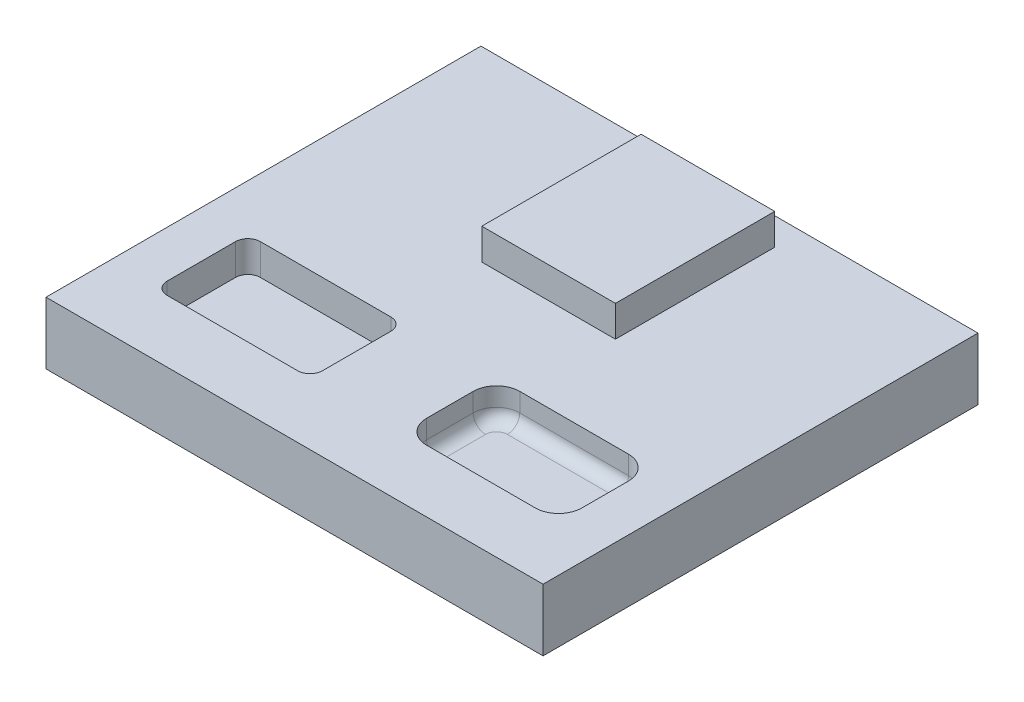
ISO-10303-21;
HEADER;
FILE_DESCRIPTION(('STEP AP214'),'2;1');
FILE_NAME('part.step','',(''),(''),'','','');
FILE_SCHEMA(('AUTOMOTIVE_DESIGN { 1 0 10303 214 1 1 1 1 }'));
ENDSEC;
DATA;
#1=APPLICATION_CONTEXT('core data for automotive mechanical design processes');
#2=APPLICATION_PROTOCOL_DEFINITION('international standard','automotive_design',2000,#1);
#3=PRODUCT_CONTEXT('',#1,'mechanical');
#4=PRODUCT('Part','Part','',(#3));
#5=PRODUCT_RELATED_PRODUCT_CATEGORY('part','',(#4));
#6=PRODUCT_DEFINITION_FORMATION('','',#4);
#7=PRODUCT_DEFINITION_CONTEXT('part definition',#1,'design');
#8=PRODUCT_DEFINITION('design','',#6,#7);
#9=PRODUCT_DEFINITION_SHAPE('','',#8);
#10=(LENGTH_UNIT() NAMED_UNIT(*) SI_UNIT(.MILLI.,.METRE.));
#11=(NAMED_UNIT(*) PLANE_ANGLE_UNIT() SI_UNIT($,.RADIAN.));
#12=(NAMED_UNIT(*) SI_UNIT($,.STERADIAN.) SOLID_ANGLE_UNIT());
#13=UNCERTAINTY_MEASURE_WITH_UNIT(LENGTH_MEASURE(1.E-05),#10,'distance_accuracy_value','');
#14=(GEOMETRIC_REPRESENTATION_CONTEXT(3) GLOBAL_UNCERTAINTY_ASSIGNED_CONTEXT((#13)) GLOBAL_UNIT_ASSIGNED_CONTEXT((#10,
#11,#12)) REPRESENTATION_CONTEXT('',''));
#15=CARTESIAN_POINT('',(0.,0.,0.));
#16=DIRECTION('',(0.,0.,1.));
#17=DIRECTION('',(1.,0.,0.));
#18=AXIS2_PLACEMENT_3D('',#15,#16,#17);
#19=CARTESIAN_POINT('',(60.325,6.35,57.15));
#20=DIRECTION('',(0.,1.,0.));
#21=DIRECTION('',(0.,0.,1.));
#22=AXIS2_PLACEMENT_3D('',#19,#20,#21);
#23=PLANE('',#22);
#24=CARTESIAN_POINT('',(87.3125,6.35,61.9125));
#25=DIRECTION('',(0.,1.,0.));
#26=DIRECTION('',(0.,0.,1.));
#27=AXIS2_PLACEMENT_3D('',#24,#25,#26);
#28=CIRCLE('',#27,2.2225);
#29=CARTESIAN_POINT('',(87.3125,6.35,59.69));
#30=VERTEX_POINT('',#29);
#31=CARTESIAN_POINT('',(89.535,6.35,61.9125));
#32=VERTEX_POINT('',#31);
#33=EDGE_CURVE('E400',#30,#32,#28,.F.);
#34=ORIENTED_EDGE('',*,*,#33,.F.);
#35=DIRECTION('',(-1.,0.,0.));
#36=VECTOR('',#35,1.);
#37=CARTESIAN_POINT('',(60.325,6.35,59.69));
#38=LINE('',#37,#36);
#39=CARTESIAN_POINT('',(65.0875,6.35,59.69));
#40=VERTEX_POINT('',#39);
#41=EDGE_CURVE('E334',#30,#40,#38,.T.);
#42=ORIENTED_EDGE('',*,*,#41,.T.);
#43=CARTESIAN_POINT('',(65.0875,6.35,61.9125));
#44=DIRECTION('',(0.,1.,0.));
#45=DIRECTION('',(0.,0.,1.));
#46=AXIS2_PLACEMENT_3D('',#43,#44,#45);
#47=CIRCLE('',#46,2.2225);
#48=CARTESIAN_POINT('',(62.865,6.35,61.9125));
#49=VERTEX_POINT('',#48);
#50=EDGE_CURVE('E393',#49,#40,#47,.F.);
#51=ORIENTED_EDGE('',*,*,#50,.F.);
#52=DIRECTION('',(0.,0.,1.));
#53=VECTOR('',#52,1.);
#54=CARTESIAN_POINT('',(62.865,6.35,57.15));
#55=LINE('',#54,#53);
#56=CARTESIAN_POINT('',(62.865,6.35,71.4375));
#57=VERTEX_POINT('',#56);
#58=EDGE_CURVE('E337',#49,#57,#55,.T.);
#59=ORIENTED_EDGE('',*,*,#58,.T.);
#60=CARTESIAN_POINT('',(65.0875,6.35,71.4375));
#61=DIRECTION('',(0.,1.,0.));
#62=DIRECTION('',(0.,0.,1.));
#63=AXIS2_PLACEMENT_3D('',#60,#61,#62);
#64=CIRCLE('',#63,2.2225);
#65=CARTESIAN_POINT('',(65.0875,6.35,73.66));
#66=VERTEX_POINT('',#65);
#67=EDGE_CURVE('E396',#66,#57,#64,.F.);
#68=ORIENTED_EDGE('',*,*,#67,.F.);
#69=DIRECTION('',(1.,0.,0.));
#70=VECTOR('',#69,1.);
#71=CARTESIAN_POINT('',(60.325,6.35,73.66));
#72=LINE('',#71,#70);
#73=CARTESIAN_POINT('',(87.3125,6.35,73.66));
#74=VERTEX_POINT('',#73);
#75=EDGE_CURVE('E340',#66,#74,#72,.T.);
#76=ORIENTED_EDGE('',*,*,#75,.T.);
#77=CARTESIAN_POINT('',(87.3125,6.35,71.4375));
#78=DIRECTION('',(0.,1.,0.));
#79=DIRECTION('',(0.,0.,1.));
#80=AXIS2_PLACEMENT_3D('',#77,#78,#79);
#81=CIRCLE('',#80,2.2225);
#82=CARTESIAN_POINT('',(89.535,6.35,71.4375));
#83=VERTEX_POINT('',#82);
#84=EDGE_CURVE('E398',#83,#74,#81,.F.);
#85=ORIENTED_EDGE('',*,*,#84,.F.);
#86=DIRECTION('',(0.,0.,-1.));
#87=VECTOR('',#86,1.);
#88=CARTESIAN_POINT('',(89.535,6.35,57.15));
#89=LINE('',#88,#87);
#90=EDGE_CURVE('E343',#83,#32,#89,.T.);
#91=ORIENTED_EDGE('',*,*,#90,.T.);
#92=EDGE_LOOP('',(#34,#42,#51,#59,#68,#76,#85,#91));
#93=FACE_BOUND('',#92,.T.);
#94=ADVANCED_FACE('F40',(#93),#23,.T.);
#95=CARTESIAN_POINT('',(0.,12.7,88.9));
#96=DIRECTION('',(0.,1.,0.));
#97=DIRECTION('',(0.,0.,1.));
#98=AXIS2_PLACEMENT_3D('',#95,#96,#97);
#99=PLANE('',#98);
#100=DIRECTION('',(1.,0.,0.));
#101=VECTOR('',#100,1.);
#102=CARTESIAN_POINT('',(0.,12.7,88.9));
#103=LINE('',#102,#101);
#104=CARTESIAN_POINT('',(0.,12.7,88.9));
#105=VERTEX_POINT('',#104);
#106=CARTESIAN_POINT('',(101.6,12.7,88.9));
#107=VERTEX_POINT('',#106);
#108=EDGE_CURVE('E313',#105,#107,#103,.T.);
#109=ORIENTED_EDGE('',*,*,#108,.T.);
#110=DIRECTION('',(0.,0.,-1.));
#111=VECTOR('',#110,1.);
#112=CARTESIAN_POINT('',(101.6,12.7,0.));
#113=LINE('',#112,#111);
#114=CARTESIAN_POINT('',(101.6,12.7,0.));
#115=VERTEX_POINT('',#114);
#116=EDGE_CURVE('E316',#107,#115,#113,.T.);
#117=ORIENTED_EDGE('',*,*,#116,.T.);
#118=DIRECTION('',(-1.,0.,0.));
#119=VECTOR('',#118,1.);
#120=CARTESIAN_POINT('',(0.,12.7,0.));
#121=LINE('',#120,#119);
#122=CARTESIAN_POINT('',(0.,12.7,0.));
#123=VERTEX_POINT('',#122);
#124=EDGE_CURVE('E318',#115,#123,#121,.T.);
#125=ORIENTED_EDGE('',*,*,#124,.T.);
#126=DIRECTION('',(0.,0.,1.));
#127=VECTOR('',#126,1.);
#128=CARTESIAN_POINT('',(0.,12.7,88.9));
#129=LINE('',#128,#127);
#130=EDGE_CURVE('E320',#123,#105,#129,.T.);
#131=ORIENTED_EDGE('',*,*,#130,.T.);
#132=EDGE_LOOP('',(#109,#117,#125,#131));
#133=FACE_BOUND('',#132,.T.);
#134=DIRECTION('',(0.,0.,1.));
#135=VECTOR('',#134,1.);
#136=CARTESIAN_POINT('',(9.525,12.7,57.15));
#137=LINE('',#136,#135);
#138=CARTESIAN_POINT('',(9.525,12.7,59.69));
#139=VERTEX_POINT('',#138);
#140=CARTESIAN_POINT('',(9.52500000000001,12.7,73.66));
#141=VERTEX_POINT('',#140);
#142=EDGE_CURVE('E280',#139,#141,#137,.T.);
#143=ORIENTED_EDGE('',*,*,#142,.F.);
#144=CARTESIAN_POINT('',(12.065,12.7,59.69));
#145=DIRECTION('',(0.,1.,0.));
#146=DIRECTION('',(0.,0.,1.));
#147=AXIS2_PLACEMENT_3D('',#144,#145,#146);
#148=CIRCLE('',#147,2.54);
#149=CARTESIAN_POINT('',(12.065,12.7,57.15));
#150=VERTEX_POINT('',#149);
#151=EDGE_CURVE('E391',#139,#150,#148,.F.);
#152=ORIENTED_EDGE('',*,*,#151,.T.);
#153=DIRECTION('',(-1.,0.,0.));
#154=VECTOR('',#153,1.);
#155=CARTESIAN_POINT('',(9.525,12.7,57.15));
#156=LINE('',#155,#154);
#157=CARTESIAN_POINT('',(38.735,12.7,57.15));
#158=VERTEX_POINT('',#157);
#159=EDGE_CURVE('E289',#158,#150,#156,.T.);
#160=ORIENTED_EDGE('',*,*,#159,.F.);
#161=CARTESIAN_POINT('',(38.735,12.7,59.69));
#162=DIRECTION('',(0.,1.,0.));
#163=DIRECTION('',(0.,0.,1.));
#164=AXIS2_PLACEMENT_3D('',#161,#162,#163);
#165=CIRCLE('',#164,2.54);
#166=CARTESIAN_POINT('',(41.275,12.7,59.69));
#167=VERTEX_POINT('',#166);
#168=EDGE_CURVE('E387',#158,#167,#165,.F.);
#169=ORIENTED_EDGE('',*,*,#168,.T.);
#170=DIRECTION('',(0.,0.,-1.));
#171=VECTOR('',#170,1.);
#172=CARTESIAN_POINT('',(41.275,12.7,57.15));
#173=LINE('',#172,#171);
#174=CARTESIAN_POINT('',(41.275,12.7,73.66));
#175=VERTEX_POINT('',#174);
#176=EDGE_CURVE('E286',#175,#167,#173,.T.);
#177=ORIENTED_EDGE('',*,*,#176,.F.);
#178=CARTESIAN_POINT('',(38.735,12.7,73.66));
#179=DIRECTION('',(0.,1.,0.));
#180=DIRECTION('',(0.,0.,1.));
#181=AXIS2_PLACEMENT_3D('',#178,#179,#180);
#182=CIRCLE('',#181,2.54);
#183=CARTESIAN_POINT('',(38.735,12.7,76.2));
#184=VERTEX_POINT('',#183);
#185=EDGE_CURVE('E385',#175,#184,#182,.F.);
#186=ORIENTED_EDGE('',*,*,#185,.T.);
#187=DIRECTION('',(1.,0.,0.));
#188=VECTOR('',#187,1.);
#189=CARTESIAN_POINT('',(9.52500000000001,12.7,76.2));
#190=LINE('',#189,#188);
#191=CARTESIAN_POINT('',(12.065,12.7,76.2));
#192=VERTEX_POINT('',#191);
#193=EDGE_CURVE('E283',#192,#184,#190,.T.);
#194=ORIENTED_EDGE('',*,*,#193,.F.);
#195=CARTESIAN_POINT('',(12.065,12.7,73.66));
#196=DIRECTION('',(0.,1.,0.));
#197=DIRECTION('',(0.,0.,1.));
#198=AXIS2_PLACEMENT_3D('',#195,#196,#197);
#199=CIRCLE('',#198,2.54);
#200=EDGE_CURVE('E389',#192,#141,#199,.F.);
#201=ORIENTED_EDGE('',*,*,#200,.T.);
#202=EDGE_LOOP('',(#143,#152,#160,#169,#177,#186,#194,#201));
#203=FACE_BOUND('',#202,.T.);
#204=DIRECTION('',(0.,0.,1.));
#205=VECTOR('',#204,1.);
#206=CARTESIAN_POINT('',(60.325,12.7,57.15));
#207=LINE('',#206,#205);
#208=CARTESIAN_POINT('',(60.325,12.7,61.9125));
#209=VERTEX_POINT('',#208);
#210=CARTESIAN_POINT('',(60.325,12.7,71.4375));
#211=VERTEX_POINT('',#210);
#212=EDGE_CURVE('E235',#209,#211,#207,.T.);
#213=ORIENTED_EDGE('',*,*,#212,.F.);
#214=CARTESIAN_POINT('',(65.0875,12.7,61.9125));
#215=DIRECTION('',(0.,1.,0.));
#216=DIRECTION('',(0.,0.,1.));
#217=AXIS2_PLACEMENT_3D('',#214,#215,#216);
#218=CIRCLE('',#217,4.7625);
#219=CARTESIAN_POINT('',(65.0875,12.7,57.15));
#220=VERTEX_POINT('',#219);
#221=EDGE_CURVE('E436',#209,#220,#218,.F.);
#222=ORIENTED_EDGE('',*,*,#221,.T.);
#223=DIRECTION('',(-1.,0.,0.));
#224=VECTOR('',#223,1.);
#225=CARTESIAN_POINT('',(60.325,12.7,57.15));
#226=LINE('',#225,#224);
#227=CARTESIAN_POINT('',(87.3125,12.7,57.15));
#228=VERTEX_POINT('',#227);
#229=EDGE_CURVE('E277',#228,#220,#226,.T.);
#230=ORIENTED_EDGE('',*,*,#229,.F.);
#231=CARTESIAN_POINT('',(87.3125,12.7,61.9125));
#232=DIRECTION('',(0.,1.,0.));
#233=DIRECTION('',(0.,0.,1.));
#234=AXIS2_PLACEMENT_3D('',#231,#232,#233);
#235=CIRCLE('',#234,4.7625);
#236=CARTESIAN_POINT('',(92.075,12.7,61.9125));
#237=VERTEX_POINT('',#236);
#238=EDGE_CURVE('E12',#228,#237,#235,.F.);
#239=ORIENTED_EDGE('',*,*,#238,.T.);
#240=DIRECTION('',(0.,0.,-1.));
#241=VECTOR('',#240,1.);
#242=CARTESIAN_POINT('',(92.075,12.7,57.15));
#243=LINE('',#242,#241);
#244=CARTESIAN_POINT('',(92.075,12.7,71.4375));
#245=VERTEX_POINT('',#244);
#246=EDGE_CURVE('E275',#245,#237,#243,.T.);
#247=ORIENTED_EDGE('',*,*,#246,.F.);
#248=CARTESIAN_POINT('',(87.3125,12.7,71.4375));
#249=DIRECTION('',(0.,1.,0.));
#250=DIRECTION('',(0.,0.,1.));
#251=AXIS2_PLACEMENT_3D('',#248,#249,#250);
#252=CIRCLE('',#251,4.7625);
#253=CARTESIAN_POINT('',(87.3125,12.7,76.2));
#254=VERTEX_POINT('',#253);
#255=EDGE_CURVE('E48',#245,#254,#252,.F.);
#256=ORIENTED_EDGE('',*,*,#255,.T.);
#257=DIRECTION('',(1.,0.,0.));
#258=VECTOR('',#257,1.);
#259=CARTESIAN_POINT('',(60.325,12.7,76.2));
#260=LINE('',#259,#258);
#261=CARTESIAN_POINT('',(65.0875,12.7,76.2));
#262=VERTEX_POINT('',#261);
#263=EDGE_CURVE('E272',#262,#254,#260,.T.);
#264=ORIENTED_EDGE('',*,*,#263,.F.);
#265=CARTESIAN_POINT('',(65.0875,12.7,71.4375));
#266=DIRECTION('',(0.,1.,0.));
#267=DIRECTION('',(0.,0.,1.));
#268=AXIS2_PLACEMENT_3D('',#265,#266,#267);
#269=CIRCLE('',#268,4.7625);
#270=EDGE_CURVE('E438',#262,#211,#269,.F.);
#271=ORIENTED_EDGE('',*,*,#270,.T.);
#272=EDGE_LOOP('',(#213,#222,#230,#239,#247,#256,#264,#271));
#273=FACE_BOUND('',#272,.T.);
#274=DIRECTION('',(-1.,0.,0.));
#275=VECTOR('',#274,1.);
#276=CARTESIAN_POINT('',(65.6347578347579,12.7,5.57931623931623));
#277=LINE('',#276,#275);
#278=CARTESIAN_POINT('',(65.6347578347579,12.7,5.57931623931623));
#279=VERTEX_POINT('',#278);
#280=CARTESIAN_POINT('',(38.3170940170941,12.7,5.57931623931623));
#281=VERTEX_POINT('',#280);
#282=EDGE_CURVE('E229',#279,#281,#277,.T.);
#283=ORIENTED_EDGE('',*,*,#282,.F.);
#284=DIRECTION('',(0.,0.,-1.));
#285=VECTOR('',#284,1.);
#286=CARTESIAN_POINT('',(65.6347578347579,12.7,5.57931623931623));
#287=LINE('',#286,#285);
#288=CARTESIAN_POINT('',(65.6347578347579,12.7,38.1434188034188));
#289=VERTEX_POINT('',#288);
#290=EDGE_CURVE('E240',#289,#279,#287,.T.);
#291=ORIENTED_EDGE('',*,*,#290,.F.);
#292=DIRECTION('',(1.,0.,0.));
#293=VECTOR('',#292,1.);
#294=CARTESIAN_POINT('',(65.6347578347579,12.7,38.1434188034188));
#295=LINE('',#294,#293);
#296=CARTESIAN_POINT('',(38.3170940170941,12.7,38.1434188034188));
#297=VERTEX_POINT('',#296);
#298=EDGE_CURVE('E253',#297,#289,#295,.T.);
#299=ORIENTED_EDGE('',*,*,#298,.F.);
#300=DIRECTION('',(0.,0.,1.));
#301=VECTOR('',#300,1.);
#302=CARTESIAN_POINT('',(38.3170940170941,12.7,5.57931623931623));
#303=LINE('',#302,#301);
#304=EDGE_CURVE('E251',#281,#297,#303,.T.);
#305=ORIENTED_EDGE('',*,*,#304,.F.);
#306=EDGE_LOOP('',(#283,#291,#299,#305));
#307=FACE_BOUND('',#306,.T.);
#308=ADVANCED_FACE('F249',(#133,#203,#273,#307),#99,.T.);
#309=CARTESIAN_POINT('',(0.,12.7,88.9));
#310=DIRECTION('',(0.,0.,-1.));
#311=DIRECTION('',(-1.,0.,0.));
#312=AXIS2_PLACEMENT_3D('',#309,#310,#311);
#313=PLANE('',#312);
#314=DIRECTION('',(1.,0.,0.));
#315=VECTOR('',#314,1.);
#316=CARTESIAN_POINT('',(0.,0.,88.9));
#317=LINE('',#316,#315);
#318=CARTESIAN_POINT('',(0.,0.,88.9));
#319=VERTEX_POINT('',#318);
#320=CARTESIAN_POINT('',(101.6,0.,88.9));
#321=VERTEX_POINT('',#320);
#322=EDGE_CURVE('E304',#319,#321,#317,.T.);
#323=ORIENTED_EDGE('',*,*,#322,.T.);
#324=DIRECTION('',(0.,-1.,0.));
#325=VECTOR('',#324,1.);
#326=CARTESIAN_POINT('',(101.6,12.7,88.9));
#327=LINE('',#326,#325);
#328=EDGE_CURVE('E331',#107,#321,#327,.T.);
#329=ORIENTED_EDGE('',*,*,#328,.F.);
#330=ORIENTED_EDGE('',*,*,#108,.F.);
#331=DIRECTION('',(0.,-1.,0.));
#332=VECTOR('',#331,1.);
#333=CARTESIAN_POINT('',(0.,12.7,88.9));
#334=LINE('',#333,#332);
#335=EDGE_CURVE('E322',#105,#319,#334,.T.);
#336=ORIENTED_EDGE('',*,*,#335,.T.);
#337=EDGE_LOOP('',(#323,#329,#330,#336));
#338=FACE_BOUND('',#337,.T.);
#339=ADVANCED_FACE('F42',(#338),#313,.F.);
#340=CARTESIAN_POINT('',(101.6,12.7,0.));
#341=DIRECTION('',(-1.,0.,0.));
#342=DIRECTION('',(0.,0.,1.));
#343=AXIS2_PLACEMENT_3D('',#340,#341,#342);
#344=PLANE('',#343);
#345=DIRECTION('',(0.,0.,-1.));
#346=VECTOR('',#345,1.);
#347=CARTESIAN_POINT('',(101.6,0.,0.));
#348=LINE('',#347,#346);
#349=CARTESIAN_POINT('',(101.6,0.,0.));
#350=VERTEX_POINT('',#349);
#351=EDGE_CURVE('E307',#321,#350,#348,.T.);
#352=ORIENTED_EDGE('',*,*,#351,.T.);
#353=DIRECTION('',(0.,-1.,0.));
#354=VECTOR('',#353,1.);
#355=CARTESIAN_POINT('',(101.6,12.7,0.));
#356=LINE('',#355,#354);
#357=EDGE_CURVE('E328',#115,#350,#356,.T.);
#358=ORIENTED_EDGE('',*,*,#357,.F.);
#359=ORIENTED_EDGE('',*,*,#116,.F.);
#360=ORIENTED_EDGE('',*,*,#328,.T.);
#361=EDGE_LOOP('',(#352,#358,#359,#360));
#362=FACE_BOUND('',#361,.T.);
#363=ADVANCED_FACE('F565',(#362),#344,.F.);
#364=CARTESIAN_POINT('',(0.,12.7,0.));
#365=DIRECTION('',(0.,0.,1.));
#366=DIRECTION('',(1.,0.,0.));
#367=AXIS2_PLACEMENT_3D('',#364,#365,#366);
#368=PLANE('',#367);
#369=DIRECTION('',(-1.,0.,0.));
#370=VECTOR('',#369,1.);
#371=CARTESIAN_POINT('',(0.,0.,0.));
#372=LINE('',#371,#370);
#373=CARTESIAN_POINT('',(0.,0.,0.));
#374=VERTEX_POINT('',#373);
#375=EDGE_CURVE('E309',#350,#374,#372,.T.);
#376=ORIENTED_EDGE('',*,*,#375,.T.);
#377=DIRECTION('',(0.,-1.,0.));
#378=VECTOR('',#377,1.);
#379=CARTESIAN_POINT('',(0.,12.7,0.));
#380=LINE('',#379,#378);
#381=EDGE_CURVE('E325',#123,#374,#380,.T.);
#382=ORIENTED_EDGE('',*,*,#381,.F.);
#383=ORIENTED_EDGE('',*,*,#124,.F.);
#384=ORIENTED_EDGE('',*,*,#357,.T.);
#385=EDGE_LOOP('',(#376,#382,#383,#384));
#386=FACE_BOUND('',#385,.T.);
#387=ADVANCED_FACE('F562',(#386),#368,.F.);
#388=CARTESIAN_POINT('',(0.,12.7,88.9));
#389=DIRECTION('',(1.,0.,0.));
#390=DIRECTION('',(0.,0.,-1.));
#391=AXIS2_PLACEMENT_3D('',#388,#389,#390);
#392=PLANE('',#391);
#393=DIRECTION('',(0.,0.,1.));
#394=VECTOR('',#393,1.);
#395=CARTESIAN_POINT('',(0.,0.,88.9));
#396=LINE('',#395,#394);
#397=EDGE_CURVE('E311',#374,#319,#396,.T.);
#398=ORIENTED_EDGE('',*,*,#397,.T.);
#399=ORIENTED_EDGE('',*,*,#335,.F.);
#400=ORIENTED_EDGE('',*,*,#130,.F.);
#401=ORIENTED_EDGE('',*,*,#381,.T.);
#402=EDGE_LOOP('',(#398,#399,#400,#401));
#403=FACE_BOUND('',#402,.T.);
#404=ADVANCED_FACE('F557',(#403),#392,.F.);
#405=CARTESIAN_POINT('',(0.,0.,88.9));
#406=DIRECTION('',(0.,1.,0.));
#407=DIRECTION('',(0.,0.,1.));
#408=AXIS2_PLACEMENT_3D('',#405,#406,#407);
#409=PLANE('',#408);
#410=ORIENTED_EDGE('',*,*,#322,.F.);
#411=ORIENTED_EDGE('',*,*,#397,.F.);
#412=ORIENTED_EDGE('',*,*,#375,.F.);
#413=ORIENTED_EDGE('',*,*,#351,.F.);
#414=EDGE_LOOP('',(#410,#411,#412,#413));
#415=FACE_BOUND('',#414,.T.);
#416=ADVANCED_FACE('F554',(#415),#409,.F.);
#417=CARTESIAN_POINT('',(9.525,6.35,57.15));
#418=DIRECTION('',(-1.,0.,0.));
#419=DIRECTION('',(0.,0.,1.));
#420=AXIS2_PLACEMENT_3D('',#417,#418,#419);
#421=PLANE('',#420);
#422=ORIENTED_EDGE('',*,*,#142,.T.);
#423=DIRECTION('',(0.,1.,0.));
#424=VECTOR('',#423,1.);
#425=CARTESIAN_POINT('',(9.52500000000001,6.35,73.66));
#426=LINE('',#425,#424);
#427=CARTESIAN_POINT('',(9.52500000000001,6.35,73.66));
#428=VERTEX_POINT('',#427);
#429=EDGE_CURVE('E383',#141,#428,#426,.F.);
#430=ORIENTED_EDGE('',*,*,#429,.T.);
#431=DIRECTION('',(0.,0.,1.));
#432=VECTOR('',#431,1.);
#433=CARTESIAN_POINT('',(9.525,6.35,57.15));
#434=LINE('',#433,#432);
#435=CARTESIAN_POINT('',(9.525,6.35,59.69));
#436=VERTEX_POINT('',#435);
#437=EDGE_CURVE('E292',#436,#428,#434,.T.);
#438=ORIENTED_EDGE('',*,*,#437,.F.);
#439=DIRECTION('',(0.,1.,0.));
#440=VECTOR('',#439,1.);
#441=CARTESIAN_POINT('',(9.525,12.7,59.69));
#442=LINE('',#441,#440);
#443=EDGE_CURVE('E380',#436,#139,#442,.T.);
#444=ORIENTED_EDGE('',*,*,#443,.T.);
#445=EDGE_LOOP('',(#422,#430,#438,#444));
#446=FACE_BOUND('',#445,.T.);
#447=ADVANCED_FACE('F544',(#446),#421,.F.);
#448=CARTESIAN_POINT('',(9.525,6.35,57.15));
#449=DIRECTION('',(0.,0.,-1.));
#450=DIRECTION('',(-1.,0.,0.));
#451=AXIS2_PLACEMENT_3D('',#448,#449,#450);
#452=PLANE('',#451);
#453=DIRECTION('',(-1.,0.,0.));
#454=VECTOR('',#453,1.);
#455=CARTESIAN_POINT('',(9.525,6.35,57.15));
#456=LINE('',#455,#454);
#457=CARTESIAN_POINT('',(38.735,6.35,57.15));
#458=VERTEX_POINT('',#457);
#459=CARTESIAN_POINT('',(12.065,6.35,57.15));
#460=VERTEX_POINT('',#459);
#461=EDGE_CURVE('E301',#458,#460,#456,.T.);
#462=ORIENTED_EDGE('',*,*,#461,.F.);
#463=DIRECTION('',(0.,1.,0.));
#464=VECTOR('',#463,1.);
#465=CARTESIAN_POINT('',(38.735,12.7,57.15));
#466=LINE('',#465,#464);
#467=EDGE_CURVE('E377',#458,#158,#466,.T.);
#468=ORIENTED_EDGE('',*,*,#467,.T.);
#469=ORIENTED_EDGE('',*,*,#159,.T.);
#470=DIRECTION('',(0.,1.,0.));
#471=VECTOR('',#470,1.);
#472=CARTESIAN_POINT('',(12.065,6.35,57.15));
#473=LINE('',#472,#471);
#474=EDGE_CURVE('E375',#150,#460,#473,.F.);
#475=ORIENTED_EDGE('',*,*,#474,.T.);
#476=EDGE_LOOP('',(#462,#468,#469,#475));
#477=FACE_BOUND('',#476,.T.);
#478=ADVANCED_FACE('F540',(#477),#452,.F.);
#479=CARTESIAN_POINT('',(41.275,6.35,57.15));
#480=DIRECTION('',(1.,0.,0.));
#481=DIRECTION('',(0.,0.,-1.));
#482=AXIS2_PLACEMENT_3D('',#479,#480,#481);
#483=PLANE('',#482);
#484=DIRECTION('',(0.,0.,-1.));
#485=VECTOR('',#484,1.);
#486=CARTESIAN_POINT('',(41.275,6.35,57.15));
#487=LINE('',#486,#485);
#488=CARTESIAN_POINT('',(41.275,6.35,73.66));
#489=VERTEX_POINT('',#488);
#490=CARTESIAN_POINT('',(41.275,6.35,59.69));
#491=VERTEX_POINT('',#490);
#492=EDGE_CURVE('E298',#489,#491,#487,.T.);
#493=ORIENTED_EDGE('',*,*,#492,.F.);
#494=DIRECTION('',(0.,1.,0.));
#495=VECTOR('',#494,1.);
#496=CARTESIAN_POINT('',(41.275,12.7,73.66));
#497=LINE('',#496,#495);
#498=EDGE_CURVE('E359',#489,#175,#497,.T.);
#499=ORIENTED_EDGE('',*,*,#498,.T.);
#500=ORIENTED_EDGE('',*,*,#176,.T.);
#501=DIRECTION('',(0.,1.,0.));
#502=VECTOR('',#501,1.);
#503=CARTESIAN_POINT('',(41.275,6.35,59.69));
#504=LINE('',#503,#502);
#505=EDGE_CURVE('E357',#167,#491,#504,.F.);
#506=ORIENTED_EDGE('',*,*,#505,.T.);
#507=EDGE_LOOP('',(#493,#499,#500,#506));
#508=FACE_BOUND('',#507,.T.);
#509=ADVANCED_FACE('F543',(#508),#483,.F.);
#510=CARTESIAN_POINT('',(9.52500000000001,6.35,76.2));
#511=DIRECTION('',(0.,0.,1.));
#512=DIRECTION('',(1.,0.,0.));
#513=AXIS2_PLACEMENT_3D('',#510,#511,#512);
#514=PLANE('',#513);
#515=ORIENTED_EDGE('',*,*,#193,.T.);
#516=DIRECTION('',(0.,1.,0.));
#517=VECTOR('',#516,1.);
#518=CARTESIAN_POINT('',(38.735,6.35,76.2));
#519=LINE('',#518,#517);
#520=CARTESIAN_POINT('',(38.735,6.35,76.2));
#521=VERTEX_POINT('',#520);
#522=EDGE_CURVE('E365',#184,#521,#519,.F.);
#523=ORIENTED_EDGE('',*,*,#522,.T.);
#524=DIRECTION('',(1.,0.,0.));
#525=VECTOR('',#524,1.);
#526=CARTESIAN_POINT('',(9.52500000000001,6.35,76.2));
#527=LINE('',#526,#525);
#528=CARTESIAN_POINT('',(12.065,6.35,76.2));
#529=VERTEX_POINT('',#528);
#530=EDGE_CURVE('E295',#529,#521,#527,.T.);
#531=ORIENTED_EDGE('',*,*,#530,.F.);
#532=DIRECTION('',(0.,1.,0.));
#533=VECTOR('',#532,1.);
#534=CARTESIAN_POINT('',(12.065,12.7,76.2));
#535=LINE('',#534,#533);
#536=EDGE_CURVE('E362',#529,#192,#535,.T.);
#537=ORIENTED_EDGE('',*,*,#536,.T.);
#538=EDGE_LOOP('',(#515,#523,#531,#537));
#539=FACE_BOUND('',#538,.T.);
#540=ADVANCED_FACE('F538',(#539),#514,.F.);
#541=CARTESIAN_POINT('',(9.52500000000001,6.35,76.2));
#542=DIRECTION('',(0.,1.,0.));
#543=DIRECTION('',(0.,0.,1.));
#544=AXIS2_PLACEMENT_3D('',#541,#542,#543);
#545=PLANE('',#544);
#546=ORIENTED_EDGE('',*,*,#530,.T.);
#547=CARTESIAN_POINT('',(38.735,6.35,73.66));
#548=DIRECTION('',(0.,1.,0.));
#549=DIRECTION('',(0.,0.,1.));
#550=AXIS2_PLACEMENT_3D('',#547,#548,#549);
#551=CIRCLE('',#550,2.54);
#552=EDGE_CURVE('E373',#521,#489,#551,.T.);
#553=ORIENTED_EDGE('',*,*,#552,.T.);
#554=ORIENTED_EDGE('',*,*,#492,.T.);
#555=CARTESIAN_POINT('',(38.735,6.35,59.69));
#556=DIRECTION('',(0.,1.,0.));
#557=DIRECTION('',(0.,0.,1.));
#558=AXIS2_PLACEMENT_3D('',#555,#556,#557);
#559=CIRCLE('',#558,2.54);
#560=EDGE_CURVE('E371',#491,#458,#559,.T.);
#561=ORIENTED_EDGE('',*,*,#560,.T.);
#562=ORIENTED_EDGE('',*,*,#461,.T.);
#563=CARTESIAN_POINT('',(12.065,6.35,59.69));
#564=DIRECTION('',(0.,1.,0.));
#565=DIRECTION('',(0.,0.,1.));
#566=AXIS2_PLACEMENT_3D('',#563,#564,#565);
#567=CIRCLE('',#566,2.54);
#568=EDGE_CURVE('E367',#460,#436,#567,.T.);
#569=ORIENTED_EDGE('',*,*,#568,.T.);
#570=ORIENTED_EDGE('',*,*,#437,.T.);
#571=CARTESIAN_POINT('',(12.065,6.35,73.66));
#572=DIRECTION('',(0.,1.,0.));
#573=DIRECTION('',(0.,0.,1.));
#574=AXIS2_PLACEMENT_3D('',#571,#572,#573);
#575=CIRCLE('',#574,2.54);
#576=EDGE_CURVE('E369',#428,#529,#575,.T.);
#577=ORIENTED_EDGE('',*,*,#576,.T.);
#578=EDGE_LOOP('',(#546,#553,#554,#561,#562,#569,#570,#577));
#579=FACE_BOUND('',#578,.T.);
#580=ADVANCED_FACE('F535',(#579),#545,.T.);
#581=CARTESIAN_POINT('',(60.325,6.35,57.15));
#582=DIRECTION('',(-1.,0.,0.));
#583=DIRECTION('',(0.,0.,1.));
#584=AXIS2_PLACEMENT_3D('',#581,#582,#583);
#585=PLANE('',#584);
#586=DIRECTION('',(0.,0.,1.));
#587=VECTOR('',#586,1.);
#588=CARTESIAN_POINT('',(60.325,8.89,57.15));
#589=LINE('',#588,#587);
#590=CARTESIAN_POINT('',(60.325,8.89,71.4375));
#591=VERTEX_POINT('',#590);
#592=CARTESIAN_POINT('',(60.325,8.89,61.9125));
#593=VERTEX_POINT('',#592);
#594=EDGE_CURVE('E351',#591,#593,#589,.F.);
#595=ORIENTED_EDGE('',*,*,#594,.T.);
#596=DIRECTION('',(0.,1.,0.));
#597=VECTOR('',#596,1.);
#598=CARTESIAN_POINT('',(60.325,12.7,61.9125));
#599=LINE('',#598,#597);
#600=EDGE_CURVE('E423',#593,#209,#599,.T.);
#601=ORIENTED_EDGE('',*,*,#600,.T.);
#602=ORIENTED_EDGE('',*,*,#212,.T.);
#603=DIRECTION('',(0.,1.,0.));
#604=VECTOR('',#603,1.);
#605=CARTESIAN_POINT('',(60.325,8.89,71.4375));
#606=LINE('',#605,#604);
#607=EDGE_CURVE('E421',#211,#591,#606,.F.);
#608=ORIENTED_EDGE('',*,*,#607,.T.);
#609=EDGE_LOOP('',(#595,#601,#602,#608));
#610=FACE_BOUND('',#609,.T.);
#611=ADVANCED_FACE('F528',(#610),#585,.F.);
#612=CARTESIAN_POINT('',(60.325,6.35,57.15));
#613=DIRECTION('',(0.,0.,-1.));
#614=DIRECTION('',(-1.,0.,0.));
#615=AXIS2_PLACEMENT_3D('',#612,#613,#614);
#616=PLANE('',#615);
#617=ORIENTED_EDGE('',*,*,#229,.T.);
#618=DIRECTION('',(0.,1.,0.));
#619=VECTOR('',#618,1.);
#620=CARTESIAN_POINT('',(65.0875,8.89,57.15));
#621=LINE('',#620,#619);
#622=CARTESIAN_POINT('',(65.0875,8.89,57.15));
#623=VERTEX_POINT('',#622);
#624=EDGE_CURVE('E427',#220,#623,#621,.F.);
#625=ORIENTED_EDGE('',*,*,#624,.T.);
#626=DIRECTION('',(-1.,0.,0.));
#627=VECTOR('',#626,1.);
#628=CARTESIAN_POINT('',(60.325,8.89,57.15));
#629=LINE('',#628,#627);
#630=CARTESIAN_POINT('',(87.3125,8.89,57.15));
#631=VERTEX_POINT('',#630);
#632=EDGE_CURVE('E354',#623,#631,#629,.F.);
#633=ORIENTED_EDGE('',*,*,#632,.T.);
#634=DIRECTION('',(0.,1.,0.));
#635=VECTOR('',#634,1.);
#636=CARTESIAN_POINT('',(87.3125,12.7,57.15));
#637=LINE('',#636,#635);
#638=EDGE_CURVE('E425',#631,#228,#637,.T.);
#639=ORIENTED_EDGE('',*,*,#638,.T.);
#640=EDGE_LOOP('',(#617,#625,#633,#639));
#641=FACE_BOUND('',#640,.T.);
#642=ADVANCED_FACE('F495',(#641),#616,.F.);
#643=CARTESIAN_POINT('',(92.075,6.35,57.15));
#644=DIRECTION('',(1.,0.,0.));
#645=DIRECTION('',(0.,0.,-1.));
#646=AXIS2_PLACEMENT_3D('',#643,#644,#645);
#647=PLANE('',#646);
#648=DIRECTION('',(0.,0.,-1.));
#649=VECTOR('',#648,1.);
#650=CARTESIAN_POINT('',(92.075,8.89,57.15));
#651=LINE('',#650,#649);
#652=CARTESIAN_POINT('',(92.075,8.89,61.9125));
#653=VERTEX_POINT('',#652);
#654=CARTESIAN_POINT('',(92.075,8.89,71.4375));
#655=VERTEX_POINT('',#654);
#656=EDGE_CURVE('E346',#653,#655,#651,.F.);
#657=ORIENTED_EDGE('',*,*,#656,.T.);
#658=DIRECTION('',(0.,1.,0.));
#659=VECTOR('',#658,1.);
#660=CARTESIAN_POINT('',(92.075,12.7,71.4375));
#661=LINE('',#660,#659);
#662=EDGE_CURVE('E60',#655,#245,#661,.T.);
#663=ORIENTED_EDGE('',*,*,#662,.T.);
#664=ORIENTED_EDGE('',*,*,#246,.T.);
#665=DIRECTION('',(0.,1.,0.));
#666=VECTOR('',#665,1.);
#667=CARTESIAN_POINT('',(92.075,8.89,61.9125));
#668=LINE('',#667,#666);
#669=EDGE_CURVE('E433',#237,#653,#668,.F.);
#670=ORIENTED_EDGE('',*,*,#669,.T.);
#671=EDGE_LOOP('',(#657,#663,#664,#670));
#672=FACE_BOUND('',#671,.T.);
#673=ADVANCED_FACE('F527',(#672),#647,.F.);
#674=CARTESIAN_POINT('',(60.325,6.35,76.2));
#675=DIRECTION('',(0.,0.,1.));
#676=DIRECTION('',(1.,0.,0.));
#677=AXIS2_PLACEMENT_3D('',#674,#675,#676);
#678=PLANE('',#677);
#679=DIRECTION('',(1.,0.,0.));
#680=VECTOR('',#679,1.);
#681=CARTESIAN_POINT('',(60.325,8.89,76.2));
#682=LINE('',#681,#680);
#683=CARTESIAN_POINT('',(87.3125,8.89,76.2));
#684=VERTEX_POINT('',#683);
#685=CARTESIAN_POINT('',(65.0875,8.89,76.2));
#686=VERTEX_POINT('',#685);
#687=EDGE_CURVE('E348',#684,#686,#682,.F.);
#688=ORIENTED_EDGE('',*,*,#687,.T.);
#689=DIRECTION('',(0.,1.,0.));
#690=VECTOR('',#689,1.);
#691=CARTESIAN_POINT('',(65.0875,12.7,76.2));
#692=LINE('',#691,#690);
#693=EDGE_CURVE('E431',#686,#262,#692,.T.);
#694=ORIENTED_EDGE('',*,*,#693,.T.);
#695=ORIENTED_EDGE('',*,*,#263,.T.);
#696=DIRECTION('',(0.,1.,0.));
#697=VECTOR('',#696,1.);
#698=CARTESIAN_POINT('',(87.3125,8.89,76.2));
#699=LINE('',#698,#697);
#700=EDGE_CURVE('E429',#254,#684,#699,.F.);
#701=ORIENTED_EDGE('',*,*,#700,.T.);
#702=EDGE_LOOP('',(#688,#694,#695,#701));
#703=FACE_BOUND('',#702,.T.);
#704=ADVANCED_FACE('F446',(#703),#678,.F.);
#705=CARTESIAN_POINT('',(62.865,8.89,57.15));
#706=DIRECTION('',(0.,0.,1.));
#707=DIRECTION('',(1.,0.,0.));
#708=AXIS2_PLACEMENT_3D('',#705,#706,#707);
#709=CYLINDRICAL_SURFACE('',#708,2.54);
#710=ORIENTED_EDGE('',*,*,#594,.F.);
#711=CARTESIAN_POINT('',(62.865,8.89,71.4375));
#712=DIRECTION('',(0.,0.,1.));
#713=DIRECTION('',(1.,0.,0.));
#714=AXIS2_PLACEMENT_3D('',#711,#712,#713);
#715=CIRCLE('',#714,2.54);
#716=EDGE_CURVE('E414',#591,#57,#715,.T.);
#717=ORIENTED_EDGE('',*,*,#716,.T.);
#718=ORIENTED_EDGE('',*,*,#58,.F.);
#719=CARTESIAN_POINT('',(62.865,8.89,61.9125));
#720=DIRECTION('',(0.,0.,-1.));
#721=DIRECTION('',(-1.,0.,0.));
#722=AXIS2_PLACEMENT_3D('',#719,#720,#721);
#723=CIRCLE('',#722,2.54);
#724=EDGE_CURVE('E412',#49,#593,#723,.T.);
#725=ORIENTED_EDGE('',*,*,#724,.T.);
#726=EDGE_LOOP('',(#710,#717,#718,#725));
#727=FACE_BOUND('',#726,.T.);
#728=ADVANCED_FACE('F474',(#727),#709,.F.);
#729=CARTESIAN_POINT('',(60.325,8.89,73.66));
#730=DIRECTION('',(1.,0.,0.));
#731=DIRECTION('',(0.,0.,-1.));
#732=AXIS2_PLACEMENT_3D('',#729,#730,#731);
#733=CYLINDRICAL_SURFACE('',#732,2.54);
#734=ORIENTED_EDGE('',*,*,#687,.F.);
#735=CARTESIAN_POINT('',(87.3125,8.89,73.66));
#736=DIRECTION('',(1.,0.,0.));
#737=DIRECTION('',(0.,0.,-1.));
#738=AXIS2_PLACEMENT_3D('',#735,#736,#737);
#739=CIRCLE('',#738,2.54);
#740=EDGE_CURVE('E409',#684,#74,#739,.T.);
#741=ORIENTED_EDGE('',*,*,#740,.T.);
#742=ORIENTED_EDGE('',*,*,#75,.F.);
#743=CARTESIAN_POINT('',(65.0875,8.89,73.66));
#744=DIRECTION('',(-1.,0.,0.));
#745=DIRECTION('',(0.,0.,1.));
#746=AXIS2_PLACEMENT_3D('',#743,#744,#745);
#747=CIRCLE('',#746,2.54);
#748=EDGE_CURVE('E407',#66,#686,#747,.T.);
#749=ORIENTED_EDGE('',*,*,#748,.T.);
#750=EDGE_LOOP('',(#734,#741,#742,#749));
#751=FACE_BOUND('',#750,.T.);
#752=ADVANCED_FACE('F461',(#751),#733,.F.);
#753=CARTESIAN_POINT('',(60.325,8.89,59.69));
#754=DIRECTION('',(-1.,0.,0.));
#755=DIRECTION('',(0.,0.,1.));
#756=AXIS2_PLACEMENT_3D('',#753,#754,#755);
#757=CYLINDRICAL_SURFACE('',#756,2.54);
#758=ORIENTED_EDGE('',*,*,#632,.F.);
#759=CARTESIAN_POINT('',(65.0875,8.89,59.69));
#760=DIRECTION('',(-1.,0.,0.));
#761=DIRECTION('',(0.,0.,1.));
#762=AXIS2_PLACEMENT_3D('',#759,#760,#761);
#763=CIRCLE('',#762,2.54);
#764=EDGE_CURVE('E419',#623,#40,#763,.T.);
#765=ORIENTED_EDGE('',*,*,#764,.T.);
#766=ORIENTED_EDGE('',*,*,#41,.F.);
#767=CARTESIAN_POINT('',(87.3125,8.89,59.69));
#768=DIRECTION('',(1.,0.,0.));
#769=DIRECTION('',(0.,0.,-1.));
#770=AXIS2_PLACEMENT_3D('',#767,#768,#769);
#771=CIRCLE('',#770,2.54);
#772=EDGE_CURVE('E417',#30,#631,#771,.T.);
#773=ORIENTED_EDGE('',*,*,#772,.T.);
#774=EDGE_LOOP('',(#758,#765,#766,#773));
#775=FACE_BOUND('',#774,.T.);
#776=ADVANCED_FACE('F504',(#775),#757,.F.);
#777=CARTESIAN_POINT('',(89.535,8.89,57.15));
#778=DIRECTION('',(0.,0.,-1.));
#779=DIRECTION('',(-1.,0.,0.));
#780=AXIS2_PLACEMENT_3D('',#777,#778,#779);
#781=CYLINDRICAL_SURFACE('',#780,2.54);
#782=ORIENTED_EDGE('',*,*,#656,.F.);
#783=CARTESIAN_POINT('',(89.535,8.89,61.9125));
#784=DIRECTION('',(0.,0.,-1.));
#785=DIRECTION('',(-1.,0.,0.));
#786=AXIS2_PLACEMENT_3D('',#783,#784,#785);
#787=CIRCLE('',#786,2.54);
#788=EDGE_CURVE('E405',#653,#32,#787,.T.);
#789=ORIENTED_EDGE('',*,*,#788,.T.);
#790=ORIENTED_EDGE('',*,*,#90,.F.);
#791=CARTESIAN_POINT('',(89.535,8.89,71.4375));
#792=DIRECTION('',(0.,0.,1.));
#793=DIRECTION('',(1.,0.,0.));
#794=AXIS2_PLACEMENT_3D('',#791,#792,#793);
#795=CIRCLE('',#794,2.54);
#796=EDGE_CURVE('E403',#83,#655,#795,.T.);
#797=ORIENTED_EDGE('',*,*,#796,.T.);
#798=EDGE_LOOP('',(#782,#789,#790,#797));
#799=FACE_BOUND('',#798,.T.);
#800=ADVANCED_FACE('F626',(#799),#781,.F.);
#801=CARTESIAN_POINT('',(38.735,6.35,73.66));
#802=DIRECTION('',(0.,-1.,0.));
#803=DIRECTION('',(0.,0.,-1.));
#804=AXIS2_PLACEMENT_3D('',#801,#802,#803);
#805=CYLINDRICAL_SURFACE('',#804,2.54);
#806=ORIENTED_EDGE('',*,*,#552,.F.);
#807=ORIENTED_EDGE('',*,*,#522,.F.);
#808=ORIENTED_EDGE('',*,*,#185,.F.);
#809=ORIENTED_EDGE('',*,*,#498,.F.);
#810=EDGE_LOOP('',(#806,#807,#808,#809));
#811=FACE_BOUND('',#810,.T.);
#812=ADVANCED_FACE('F598',(#811),#805,.F.);
#813=CARTESIAN_POINT('',(38.735,6.35,59.69));
#814=DIRECTION('',(0.,-1.,0.));
#815=DIRECTION('',(0.,0.,-1.));
#816=AXIS2_PLACEMENT_3D('',#813,#814,#815);
#817=CYLINDRICAL_SURFACE('',#816,2.54);
#818=ORIENTED_EDGE('',*,*,#560,.F.);
#819=ORIENTED_EDGE('',*,*,#505,.F.);
#820=ORIENTED_EDGE('',*,*,#168,.F.);
#821=ORIENTED_EDGE('',*,*,#467,.F.);
#822=EDGE_LOOP('',(#818,#819,#820,#821));
#823=FACE_BOUND('',#822,.T.);
#824=ADVANCED_FACE('F605',(#823),#817,.F.);
#825=CARTESIAN_POINT('',(12.065,6.35,73.66));
#826=DIRECTION('',(0.,-1.,0.));
#827=DIRECTION('',(0.,0.,-1.));
#828=AXIS2_PLACEMENT_3D('',#825,#826,#827);
#829=CYLINDRICAL_SURFACE('',#828,2.54);
#830=ORIENTED_EDGE('',*,*,#576,.F.);
#831=ORIENTED_EDGE('',*,*,#429,.F.);
#832=ORIENTED_EDGE('',*,*,#200,.F.);
#833=ORIENTED_EDGE('',*,*,#536,.F.);
#834=EDGE_LOOP('',(#830,#831,#832,#833));
#835=FACE_BOUND('',#834,.T.);
#836=ADVANCED_FACE('F592',(#835),#829,.F.);
#837=CARTESIAN_POINT('',(12.065,6.35,59.69));
#838=DIRECTION('',(0.,-1.,0.));
#839=DIRECTION('',(0.,0.,-1.));
#840=AXIS2_PLACEMENT_3D('',#837,#838,#839);
#841=CYLINDRICAL_SURFACE('',#840,2.54);
#842=ORIENTED_EDGE('',*,*,#568,.F.);
#843=ORIENTED_EDGE('',*,*,#474,.F.);
#844=ORIENTED_EDGE('',*,*,#151,.F.);
#845=ORIENTED_EDGE('',*,*,#443,.F.);
#846=EDGE_LOOP('',(#842,#843,#844,#845));
#847=FACE_BOUND('',#846,.T.);
#848=ADVANCED_FACE('F611',(#847),#841,.F.);
#849=CARTESIAN_POINT('',(65.6347578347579,19.05,5.57931623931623));
#850=DIRECTION('',(-1.,0.,0.));
#851=DIRECTION('',(0.,0.,1.));
#852=AXIS2_PLACEMENT_3D('',#849,#850,#851);
#853=PLANE('',#852);
#854=ORIENTED_EDGE('',*,*,#290,.T.);
#855=DIRECTION('',(0.,-1.,0.));
#856=VECTOR('',#855,1.);
#857=CARTESIAN_POINT('',(65.6347578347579,19.05,5.57931623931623));
#858=LINE('',#857,#856);
#859=CARTESIAN_POINT('',(65.6347578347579,19.05,5.57931623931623));
#860=VERTEX_POINT('',#859);
#861=EDGE_CURVE('E224',#860,#279,#858,.T.);
#862=ORIENTED_EDGE('',*,*,#861,.F.);
#863=DIRECTION('',(0.,0.,-1.));
#864=VECTOR('',#863,1.);
#865=CARTESIAN_POINT('',(65.6347578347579,19.05,5.57931623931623));
#866=LINE('',#865,#864);
#867=CARTESIAN_POINT('',(65.6347578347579,19.05,38.1434188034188));
#868=VERTEX_POINT('',#867);
#869=EDGE_CURVE('E258',#868,#860,#866,.T.);
#870=ORIENTED_EDGE('',*,*,#869,.F.);
#871=DIRECTION('',(0.,-1.,0.));
#872=VECTOR('',#871,1.);
#873=CARTESIAN_POINT('',(65.6347578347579,19.05,38.1434188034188));
#874=LINE('',#873,#872);
#875=EDGE_CURVE('E243',#868,#289,#874,.T.);
#876=ORIENTED_EDGE('',*,*,#875,.T.);
#877=EDGE_LOOP('',(#854,#862,#870,#876));
#878=FACE_BOUND('',#877,.T.);
#879=ADVANCED_FACE('F241',(#878),#853,.F.);
#880=CARTESIAN_POINT('',(65.6347578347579,19.05,5.57931623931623));
#881=DIRECTION('',(0.,0.,1.));
#882=DIRECTION('',(1.,0.,0.));
#883=AXIS2_PLACEMENT_3D('',#880,#881,#882);
#884=PLANE('',#883);
#885=ORIENTED_EDGE('',*,*,#282,.T.);
#886=DIRECTION('',(0.,-1.,0.));
#887=VECTOR('',#886,1.);
#888=CARTESIAN_POINT('',(38.3170940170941,19.05,5.57931623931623));
#889=LINE('',#888,#887);
#890=CARTESIAN_POINT('',(38.3170940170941,19.05,5.57931623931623));
#891=VERTEX_POINT('',#890);
#892=EDGE_CURVE('E236',#891,#281,#889,.T.);
#893=ORIENTED_EDGE('',*,*,#892,.F.);
#894=DIRECTION('',(-1.,0.,0.));
#895=VECTOR('',#894,1.);
#896=CARTESIAN_POINT('',(65.6347578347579,19.05,5.57931623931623));
#897=LINE('',#896,#895);
#898=EDGE_CURVE('E231',#860,#891,#897,.T.);
#899=ORIENTED_EDGE('',*,*,#898,.F.);
#900=ORIENTED_EDGE('',*,*,#861,.T.);
#901=EDGE_LOOP('',(#885,#893,#899,#900));
#902=FACE_BOUND('',#901,.T.);
#903=ADVANCED_FACE('F226',(#902),#884,.F.);
#904=CARTESIAN_POINT('',(38.3170940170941,19.05,5.57931623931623));
#905=DIRECTION('',(1.,0.,0.));
#906=DIRECTION('',(0.,0.,-1.));
#907=AXIS2_PLACEMENT_3D('',#904,#905,#906);
#908=PLANE('',#907);
#909=ORIENTED_EDGE('',*,*,#304,.T.);
#910=DIRECTION('',(0.,-1.,0.));
#911=VECTOR('',#910,1.);
#912=CARTESIAN_POINT('',(38.3170940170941,19.05,38.1434188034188));
#913=LINE('',#912,#911);
#914=CARTESIAN_POINT('',(38.3170940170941,19.05,38.1434188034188));
#915=VERTEX_POINT('',#914);
#916=EDGE_CURVE('E266',#915,#297,#913,.T.);
#917=ORIENTED_EDGE('',*,*,#916,.F.);
#918=DIRECTION('',(0.,0.,1.));
#919=VECTOR('',#918,1.);
#920=CARTESIAN_POINT('',(38.3170940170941,19.05,5.57931623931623));
#921=LINE('',#920,#919);
#922=EDGE_CURVE('E261',#891,#915,#921,.T.);
#923=ORIENTED_EDGE('',*,*,#922,.F.);
#924=ORIENTED_EDGE('',*,*,#892,.T.);
#925=EDGE_LOOP('',(#909,#917,#923,#924));
#926=FACE_BOUND('',#925,.T.);
#927=ADVANCED_FACE('F754',(#926),#908,.F.);
#928=CARTESIAN_POINT('',(65.6347578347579,19.05,38.1434188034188));
#929=DIRECTION('',(0.,0.,-1.));
#930=DIRECTION('',(-1.,0.,0.));
#931=AXIS2_PLACEMENT_3D('',#928,#929,#930);
#932=PLANE('',#931);
#933=ORIENTED_EDGE('',*,*,#298,.T.);
#934=ORIENTED_EDGE('',*,*,#875,.F.);
#935=DIRECTION('',(1.,0.,0.));
#936=VECTOR('',#935,1.);
#937=CARTESIAN_POINT('',(65.6347578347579,19.05,38.1434188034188));
#938=LINE('',#937,#936);
#939=EDGE_CURVE('E263',#915,#868,#938,.T.);
#940=ORIENTED_EDGE('',*,*,#939,.F.);
#941=ORIENTED_EDGE('',*,*,#916,.T.);
#942=EDGE_LOOP('',(#933,#934,#940,#941));
#943=FACE_BOUND('',#942,.T.);
#944=ADVANCED_FACE('F762',(#943),#932,.F.);
#945=CARTESIAN_POINT('',(65.6347578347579,19.05,38.1434188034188));
#946=DIRECTION('',(0.,-1.,0.));
#947=DIRECTION('',(0.,0.,-1.));
#948=AXIS2_PLACEMENT_3D('',#945,#946,#947);
#949=PLANE('',#948);
#950=ORIENTED_EDGE('',*,*,#869,.T.);
#951=ORIENTED_EDGE('',*,*,#898,.T.);
#952=ORIENTED_EDGE('',*,*,#922,.T.);
#953=ORIENTED_EDGE('',*,*,#939,.T.);
#954=EDGE_LOOP('',(#950,#951,#952,#953));
#955=FACE_BOUND('',#954,.T.);
#956=ADVANCED_FACE('F771',(#955),#949,.F.);
#957=CARTESIAN_POINT('',(87.3125,6.35,61.9125));
#958=DIRECTION('',(0.,-1.,0.));
#959=DIRECTION('',(0.,0.,-1.));
#960=AXIS2_PLACEMENT_3D('',#957,#958,#959);
#961=CYLINDRICAL_SURFACE('',#960,4.7625);
#962=ORIENTED_EDGE('',*,*,#238,.F.);
#963=ORIENTED_EDGE('',*,*,#638,.F.);
#964=CARTESIAN_POINT('',(87.3125,8.89,61.9125));
#965=DIRECTION('',(0.,1.,0.));
#966=DIRECTION('',(0.,0.,1.));
#967=AXIS2_PLACEMENT_3D('',#964,#965,#966);
#968=CIRCLE('',#967,4.7625);
#969=EDGE_CURVE('E246',#653,#631,#968,.T.);
#970=ORIENTED_EDGE('',*,*,#969,.F.);
#971=ORIENTED_EDGE('',*,*,#669,.F.);
#972=EDGE_LOOP('',(#962,#963,#970,#971));
#973=FACE_BOUND('',#972,.T.);
#974=ADVANCED_FACE('F493',(#973),#961,.F.);
#975=CARTESIAN_POINT('',(87.3125,8.89,61.9125));
#976=DIRECTION('',(0.,1.,0.));
#977=DIRECTION('',(0.,0.,1.));
#978=AXIS2_PLACEMENT_3D('',#975,#976,#977);
#979=DEGENERATE_TOROIDAL_SURFACE('',#978,2.2225,2.54,.T.);
#980=ORIENTED_EDGE('',*,*,#772,.F.);
#981=ORIENTED_EDGE('',*,*,#33,.T.);
#982=ORIENTED_EDGE('',*,*,#788,.F.);
#983=ORIENTED_EDGE('',*,*,#969,.T.);
#984=EDGE_LOOP('',(#980,#981,#982,#983));
#985=FACE_BOUND('',#984,.T.);
#986=ADVANCED_FACE('F489',(#985),#979,.F.);
#987=CARTESIAN_POINT('',(87.3125,6.35,71.4375));
#988=DIRECTION('',(0.,-1.,0.));
#989=DIRECTION('',(0.,0.,-1.));
#990=AXIS2_PLACEMENT_3D('',#987,#988,#989);
#991=CYLINDRICAL_SURFACE('',#990,4.7625);
#992=ORIENTED_EDGE('',*,*,#255,.F.);
#993=ORIENTED_EDGE('',*,*,#662,.F.);
#994=CARTESIAN_POINT('',(87.3125,8.89,71.4375));
#995=DIRECTION('',(0.,1.,0.));
#996=DIRECTION('',(0.,0.,1.));
#997=AXIS2_PLACEMENT_3D('',#994,#995,#996);
#998=CIRCLE('',#997,4.7625);
#999=EDGE_CURVE('E452',#684,#655,#998,.T.);
#1000=ORIENTED_EDGE('',*,*,#999,.F.);
#1001=ORIENTED_EDGE('',*,*,#700,.F.);
#1002=EDGE_LOOP('',(#992,#993,#1000,#1001));
#1003=FACE_BOUND('',#1002,.T.);
#1004=ADVANCED_FACE('F450',(#1003),#991,.F.);
#1005=CARTESIAN_POINT('',(87.3125,8.89,71.4375));
#1006=DIRECTION('',(0.,1.,0.));
#1007=DIRECTION('',(0.,0.,1.));
#1008=AXIS2_PLACEMENT_3D('',#1005,#1006,#1007);
#1009=DEGENERATE_TOROIDAL_SURFACE('',#1008,2.2225,2.54,.T.);
#1010=ORIENTED_EDGE('',*,*,#740,.F.);
#1011=ORIENTED_EDGE('',*,*,#999,.T.);
#1012=ORIENTED_EDGE('',*,*,#796,.F.);
#1013=ORIENTED_EDGE('',*,*,#84,.T.);
#1014=EDGE_LOOP('',(#1010,#1011,#1012,#1013));
#1015=FACE_BOUND('',#1014,.T.);
#1016=ADVANCED_FACE('F458',(#1015),#1009,.F.);
#1017=CARTESIAN_POINT('',(65.0875,6.35,71.4375));
#1018=DIRECTION('',(0.,-1.,0.));
#1019=DIRECTION('',(0.,0.,-1.));
#1020=AXIS2_PLACEMENT_3D('',#1017,#1018,#1019);
#1021=CYLINDRICAL_SURFACE('',#1020,4.7625);
#1022=ORIENTED_EDGE('',*,*,#270,.F.);
#1023=ORIENTED_EDGE('',*,*,#693,.F.);
#1024=CARTESIAN_POINT('',(65.0875,8.89,71.4375));
#1025=DIRECTION('',(0.,1.,0.));
#1026=DIRECTION('',(0.,0.,1.));
#1027=AXIS2_PLACEMENT_3D('',#1024,#1025,#1026);
#1028=CIRCLE('',#1027,4.7625);
#1029=EDGE_CURVE('E456',#591,#686,#1028,.T.);
#1030=ORIENTED_EDGE('',*,*,#1029,.F.);
#1031=ORIENTED_EDGE('',*,*,#607,.F.);
#1032=EDGE_LOOP('',(#1022,#1023,#1030,#1031));
#1033=FACE_BOUND('',#1032,.T.);
#1034=ADVANCED_FACE('F480',(#1033),#1021,.F.);
#1035=CARTESIAN_POINT('',(65.0875,8.89,71.4375));
#1036=DIRECTION('',(0.,1.,0.));
#1037=DIRECTION('',(0.,0.,1.));
#1038=AXIS2_PLACEMENT_3D('',#1035,#1036,#1037);
#1039=DEGENERATE_TOROIDAL_SURFACE('',#1038,2.2225,2.54,.T.);
#1040=ORIENTED_EDGE('',*,*,#716,.F.);
#1041=ORIENTED_EDGE('',*,*,#1029,.T.);
#1042=ORIENTED_EDGE('',*,*,#748,.F.);
#1043=ORIENTED_EDGE('',*,*,#67,.T.);
#1044=EDGE_LOOP('',(#1040,#1041,#1042,#1043));
#1045=FACE_BOUND('',#1044,.T.);
#1046=ADVANCED_FACE('F470',(#1045),#1039,.F.);
#1047=CARTESIAN_POINT('',(65.0875,6.35,61.9125));
#1048=DIRECTION('',(0.,-1.,0.));
#1049=DIRECTION('',(0.,0.,-1.));
#1050=AXIS2_PLACEMENT_3D('',#1047,#1048,#1049);
#1051=CYLINDRICAL_SURFACE('',#1050,4.7625);
#1052=ORIENTED_EDGE('',*,*,#221,.F.);
#1053=ORIENTED_EDGE('',*,*,#600,.F.);
#1054=CARTESIAN_POINT('',(65.0875,8.89,61.9125));
#1055=DIRECTION('',(0.,1.,0.));
#1056=DIRECTION('',(0.,0.,1.));
#1057=AXIS2_PLACEMENT_3D('',#1054,#1055,#1056);
#1058=CIRCLE('',#1057,4.7625);
#1059=EDGE_CURVE('E481',#623,#593,#1058,.T.);
#1060=ORIENTED_EDGE('',*,*,#1059,.F.);
#1061=ORIENTED_EDGE('',*,*,#624,.F.);
#1062=EDGE_LOOP('',(#1052,#1053,#1060,#1061));
#1063=FACE_BOUND('',#1062,.T.);
#1064=ADVANCED_FACE('F500',(#1063),#1051,.F.);
#1065=CARTESIAN_POINT('',(65.0875,8.89,61.9125));
#1066=DIRECTION('',(0.,1.,0.));
#1067=DIRECTION('',(0.,0.,1.));
#1068=AXIS2_PLACEMENT_3D('',#1065,#1066,#1067);
#1069=DEGENERATE_TOROIDAL_SURFACE('',#1068,2.2225,2.54,.T.);
#1070=ORIENTED_EDGE('',*,*,#724,.F.);
#1071=ORIENTED_EDGE('',*,*,#50,.T.);
#1072=ORIENTED_EDGE('',*,*,#764,.F.);
#1073=ORIENTED_EDGE('',*,*,#1059,.T.);
#1074=EDGE_LOOP('',(#1070,#1071,#1072,#1073));
#1075=FACE_BOUND('',#1074,.T.);
#1076=ADVANCED_FACE('F507',(#1075),#1069,.F.);
#1077=CLOSED_SHELL('',(#94,#308,#339,#363,#387,#404,#416,#447,#478,#509,#540,#580,#611,#642,
#673,#704,#728,#752,#776,#800,#812,#824,#836,#848,#879,#903,#927,#944,#956,#974,#986,#1004,
#1016,#1034,#1046,#1064,#1076));
#1078=MANIFOLD_SOLID_BREP('B2',#1077);
#1079=ADVANCED_BREP_SHAPE_REPRESENTATION('',(#18,#1078),#14);
#1080=SHAPE_DEFINITION_REPRESENTATION(#9,#1079);
ENDSEC;
END-ISO-10303-21;
